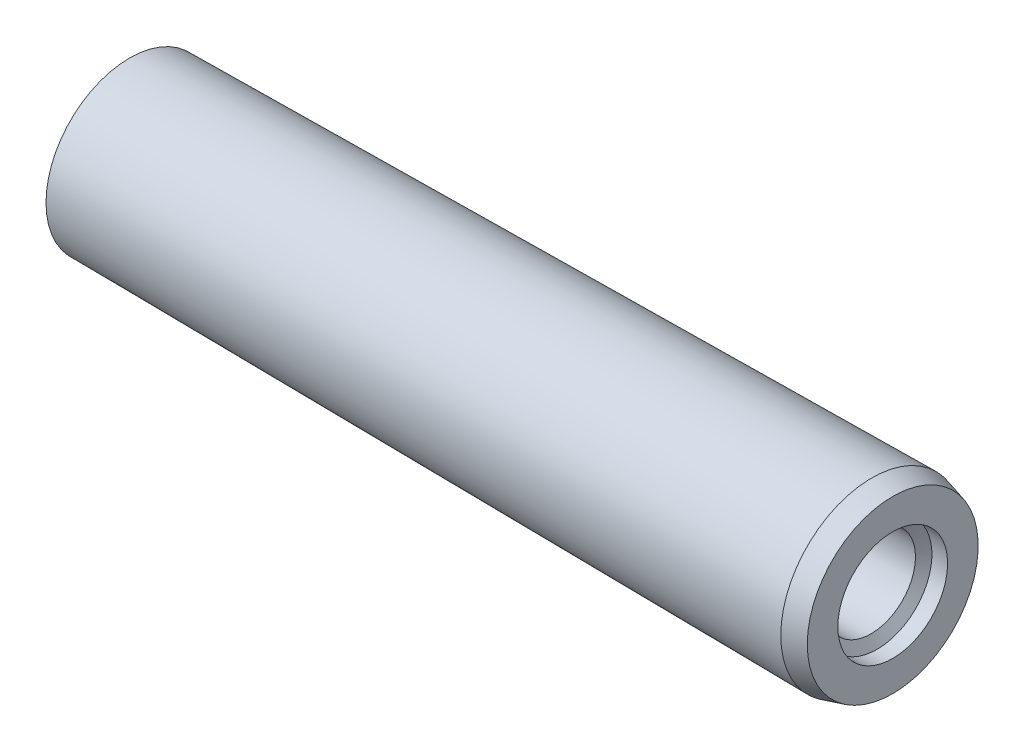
ISO-10303-21;
HEADER;
FILE_DESCRIPTION(('STEP AP214'),'2;1');
FILE_NAME('part.step','',(''),(''),'','','');
FILE_SCHEMA(('AUTOMOTIVE_DESIGN { 1 0 10303 214 1 1 1 1 }'));
ENDSEC;
DATA;
#1=APPLICATION_CONTEXT('core data for automotive mechanical design processes');
#2=APPLICATION_PROTOCOL_DEFINITION('international standard','automotive_design',2000,#1);
#3=PRODUCT_CONTEXT('',#1,'mechanical');
#4=PRODUCT('Part','Part','',(#3));
#5=PRODUCT_RELATED_PRODUCT_CATEGORY('part','',(#4));
#6=PRODUCT_DEFINITION_FORMATION('','',#4);
#7=PRODUCT_DEFINITION_CONTEXT('part definition',#1,'design');
#8=PRODUCT_DEFINITION('design','',#6,#7);
#9=PRODUCT_DEFINITION_SHAPE('','',#8);
#10=(LENGTH_UNIT() NAMED_UNIT(*) SI_UNIT(.MILLI.,.METRE.));
#11=(NAMED_UNIT(*) PLANE_ANGLE_UNIT() SI_UNIT($,.RADIAN.));
#12=(NAMED_UNIT(*) SI_UNIT($,.STERADIAN.) SOLID_ANGLE_UNIT());
#13=UNCERTAINTY_MEASURE_WITH_UNIT(LENGTH_MEASURE(1.E-05),#10,'distance_accuracy_value','');
#14=(GEOMETRIC_REPRESENTATION_CONTEXT(3) GLOBAL_UNCERTAINTY_ASSIGNED_CONTEXT((#13)) GLOBAL_UNIT_ASSIGNED_CONTEXT((#10,
#11,#12)) REPRESENTATION_CONTEXT('',''));
#15=CARTESIAN_POINT('',(0.,0.,0.));
#16=DIRECTION('',(0.,0.,1.));
#17=DIRECTION('',(1.,0.,0.));
#18=AXIS2_PLACEMENT_3D('',#15,#16,#17);
#19=CARTESIAN_POINT('',(75.,8.17410161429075,0.));
#20=DIRECTION('',(-1.,0.,0.));
#21=DIRECTION('',(0.,0.,1.));
#22=AXIS2_PLACEMENT_3D('',#19,#20,#21);
#23=PLANE('',#22);
#24=CARTESIAN_POINT('',(75.,0.,0.));
#25=DIRECTION('',(-1.,0.,0.));
#26=DIRECTION('',(0.,0.,1.));
#27=AXIS2_PLACEMENT_3D('',#24,#25,#26);
#28=CIRCLE('',#27,8.17410161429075);
#29=CARTESIAN_POINT('',(75.,0.,8.17410161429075));
#30=VERTEX_POINT('',#29);
#31=EDGE_CURVE('E11',#30,#30,#28,.T.);
#32=ORIENTED_EDGE('',*,*,#31,.F.);
#33=EDGE_LOOP('',(#32));
#34=FACE_BOUND('',#33,.T.);
#35=CARTESIAN_POINT('',(75.,0.,0.));
#36=DIRECTION('',(-1.,0.,0.));
#37=DIRECTION('',(0.,0.,1.));
#38=AXIS2_PLACEMENT_3D('',#35,#36,#37);
#39=CIRCLE('',#38,5.25);
#40=CARTESIAN_POINT('',(75.,0.,5.25));
#41=VERTEX_POINT('',#40);
#42=EDGE_CURVE('E74',#41,#41,#39,.T.);
#43=ORIENTED_EDGE('',*,*,#42,.T.);
#44=EDGE_LOOP('',(#43));
#45=FACE_BOUND('',#44,.T.);
#46=ADVANCED_FACE('F37',(#34,#45),#23,.F.);
#47=CARTESIAN_POINT('',(75.,0.,0.));
#48=DIRECTION('',(-1.,0.,0.));
#49=DIRECTION('',(0.,0.,1.));
#50=AXIS2_PLACEMENT_3D('',#47,#48,#49);
#51=CONICAL_SURFACE('',#50,8.17410161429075,0.261799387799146);
#52=CARTESIAN_POINT('',(73.,0.,0.));
#53=DIRECTION('',(-1.,0.,0.));
#54=DIRECTION('',(0.,0.,1.));
#55=AXIS2_PLACEMENT_3D('',#52,#53,#54);
#56=CIRCLE('',#55,8.70999999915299);
#57=CARTESIAN_POINT('',(73.,0.,8.70999999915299));
#58=VERTEX_POINT('',#57);
#59=EDGE_CURVE('E43',#58,#58,#56,.T.);
#60=ORIENTED_EDGE('',*,*,#59,.F.);
#61=EDGE_LOOP('',(#60));
#62=FACE_BOUND('',#61,.T.);
#63=ORIENTED_EDGE('',*,*,#31,.T.);
#64=EDGE_LOOP('',(#63));
#65=FACE_BOUND('',#64,.T.);
#66=ADVANCED_FACE('F64',(#62,#65),#51,.T.);
#67=CARTESIAN_POINT('',(73.,0.,0.));
#68=DIRECTION('',(1.,0.,0.));
#69=DIRECTION('',(0.,0.,-1.));
#70=AXIS2_PLACEMENT_3D('',#67,#68,#69);
#71=CONICAL_SURFACE('',#70,8.70999999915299,0.00999966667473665);
#72=CARTESIAN_POINT('',(2.,0.,0.));
#73=DIRECTION('',(-1.,0.,0.));
#74=DIRECTION('',(0.,0.,1.));
#75=AXIS2_PLACEMENT_3D('',#72,#73,#74);
#76=CIRCLE('',#75,8.);
#77=CARTESIAN_POINT('',(2.,0.,8.));
#78=VERTEX_POINT('',#77);
#79=EDGE_CURVE('E87',#78,#78,#76,.T.);
#80=ORIENTED_EDGE('',*,*,#79,.F.);
#81=EDGE_LOOP('',(#80));
#82=FACE_BOUND('',#81,.T.);
#83=ORIENTED_EDGE('',*,*,#59,.T.);
#84=EDGE_LOOP('',(#83));
#85=FACE_BOUND('',#84,.T.);
#86=ADVANCED_FACE('F59',(#82,#85),#71,.T.);
#87=CARTESIAN_POINT('',(17.,0.,0.));
#88=DIRECTION('',(-1.,0.,0.));
#89=DIRECTION('',(0.,1.,0.));
#90=AXIS2_PLACEMENT_3D('',#87,#88,#89);
#91=SPHERICAL_SURFACE('',#90,17.);
#92=ORIENTED_EDGE('',*,*,#79,.T.);
#93=EDGE_LOOP('',(#92));
#94=FACE_BOUND('',#93,.T.);
#95=ADVANCED_FACE('F49',(#94),#91,.T.);
#96=CARTESIAN_POINT('',(48.2395923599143,0.,0.));
#97=DIRECTION('',(1.,0.,0.));
#98=DIRECTION('',(0.,0.,-1.));
#99=AXIS2_PLACEMENT_3D('',#96,#97,#98);
#100=CONICAL_SURFACE('',#99,0.,1.17809724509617);
#101=CARTESIAN_POINT('',(50.,0.,0.));
#102=DIRECTION('',(-1.,0.,0.));
#103=DIRECTION('',(0.,0.,1.));
#104=AXIS2_PLACEMENT_3D('',#101,#102,#103);
#105=CIRCLE('',#104,4.25);
#106=CARTESIAN_POINT('',(50.,0.,4.25));
#107=VERTEX_POINT('',#106);
#108=EDGE_CURVE('E84',#107,#107,#105,.T.);
#109=ORIENTED_EDGE('',*,*,#108,.F.);
#110=EDGE_LOOP('',(#109));
#111=FACE_BOUND('',#110,.T.);
#112=CARTESIAN_POINT('',(48.2395923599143,0.,0.));
#113=VERTEX_POINT('',#112);
#114=VERTEX_LOOP('',#113);
#115=FACE_BOUND('',#114,.T.);
#116=ADVANCED_FACE('F46',(#111,#115),#100,.F.);
#117=CARTESIAN_POINT('',(0.,0.,0.));
#118=DIRECTION('',(-1.,0.,0.));
#119=DIRECTION('',(0.,0.,1.));
#120=AXIS2_PLACEMENT_3D('',#117,#118,#119);
#121=CYLINDRICAL_SURFACE('',#120,4.25);
#122=CARTESIAN_POINT('',(72.9226497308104,0.,0.));
#123=DIRECTION('',(-1.,0.,0.));
#124=DIRECTION('',(0.,0.,1.));
#125=AXIS2_PLACEMENT_3D('',#122,#123,#124);
#126=CIRCLE('',#125,4.25);
#127=CARTESIAN_POINT('',(72.9226497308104,0.,4.25));
#128=VERTEX_POINT('',#127);
#129=EDGE_CURVE('E79',#128,#128,#126,.T.);
#130=ORIENTED_EDGE('',*,*,#129,.F.);
#131=EDGE_LOOP('',(#130));
#132=FACE_BOUND('',#131,.T.);
#133=ORIENTED_EDGE('',*,*,#108,.T.);
#134=EDGE_LOOP('',(#133));
#135=FACE_BOUND('',#134,.T.);
#136=ADVANCED_FACE('F48',(#132,#135),#121,.F.);
#137=CARTESIAN_POINT('',(72.9226497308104,0.,0.));
#138=DIRECTION('',(1.,0.,0.));
#139=DIRECTION('',(0.,0.,-1.));
#140=AXIS2_PLACEMENT_3D('',#137,#138,#139);
#141=CONICAL_SURFACE('',#140,4.25,1.0471975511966);
#142=CARTESIAN_POINT('',(73.5,0.,0.));
#143=DIRECTION('',(-1.,0.,0.));
#144=DIRECTION('',(0.,0.,1.));
#145=AXIS2_PLACEMENT_3D('',#142,#143,#144);
#146=CIRCLE('',#145,5.25);
#147=CARTESIAN_POINT('',(73.5,0.,5.25));
#148=VERTEX_POINT('',#147);
#149=EDGE_CURVE('E76',#148,#148,#146,.T.);
#150=ORIENTED_EDGE('',*,*,#149,.F.);
#151=EDGE_LOOP('',(#150));
#152=FACE_BOUND('',#151,.T.);
#153=ORIENTED_EDGE('',*,*,#129,.T.);
#154=EDGE_LOOP('',(#153));
#155=FACE_BOUND('',#154,.T.);
#156=ADVANCED_FACE('F56',(#152,#155),#141,.F.);
#157=CARTESIAN_POINT('',(0.,0.,0.));
#158=DIRECTION('',(-1.,0.,0.));
#159=DIRECTION('',(0.,0.,1.));
#160=AXIS2_PLACEMENT_3D('',#157,#158,#159);
#161=CYLINDRICAL_SURFACE('',#160,5.25);
#162=ORIENTED_EDGE('',*,*,#42,.F.);
#163=EDGE_LOOP('',(#162));
#164=FACE_BOUND('',#163,.T.);
#165=ORIENTED_EDGE('',*,*,#149,.T.);
#166=EDGE_LOOP('',(#165));
#167=FACE_BOUND('',#166,.T.);
#168=ADVANCED_FACE('F126',(#164,#167),#161,.F.);
#169=CLOSED_SHELL('',(#46,#66,#86,#95,#116,#136,#156,#168));
#170=MANIFOLD_SOLID_BREP('B2',#169);
#171=ADVANCED_BREP_SHAPE_REPRESENTATION('',(#18,#170),#14);
#172=SHAPE_DEFINITION_REPRESENTATION(#9,#171);
ENDSEC;
END-ISO-10303-21;
